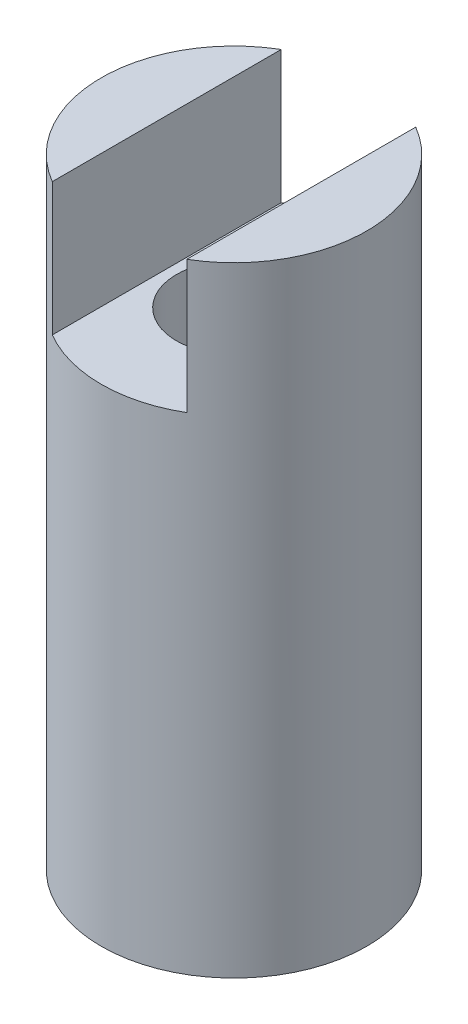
from build123d import *

# Parameters (mm, degrees)
ESQUISSE2_W             = 50
ESQUISSE2_H             = 30
ENL_V_MAT_EXTRU_1_DEPTH = 7.6


with BuildPart() as part:
    # Esquisse1 → R_volution1 (revolve)
    with BuildSketch(Plane.XY, mode=Mode.PRIVATE) as r_volution1_sk:
        Polygon((-3.25, 0), (-15, 0), (-15, 70), (-6.5, 70), (-6.5, 45), (-3.25, 41.75), align=None)
    revolve(r_volution1_sk.sketch.rotate(Axis((0, 0, 0), (0, 1, 0)), 270), axis=Axis((0, 0, 0), (0, 1, 0)))

    # Esquisse2 → Enl_v. mat.-Extru.1 (cut, symmetric)
    with BuildSketch(Plane(origin=(0, 0, 0), x_dir=(0, 0, -1), z_dir=(1, 0, 0))):
        with Locations((0, 70)):
            Rectangle(ESQUISSE2_W, ESQUISSE2_H)
    extrude(amount=ENL_V_MAT_EXTRU_1_DEPTH, both=True, mode=Mode.SUBTRACT)


solid = part.part
